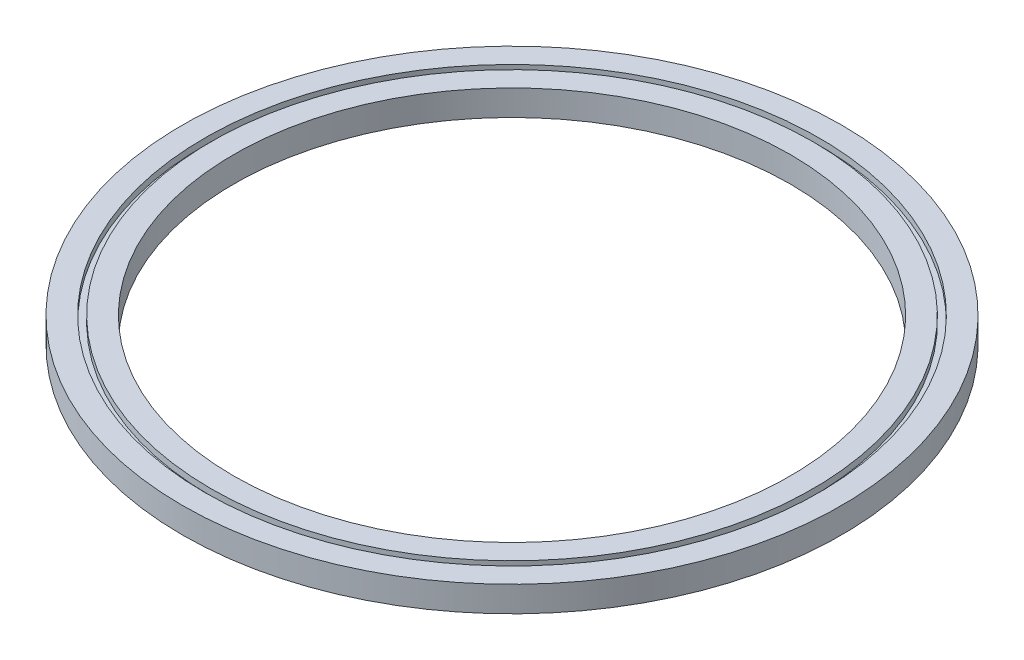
ISO-10303-21;
HEADER;
FILE_DESCRIPTION(('STEP AP214'),'2;1');
FILE_NAME('part.step','',(''),(''),'','','');
FILE_SCHEMA(('AUTOMOTIVE_DESIGN { 1 0 10303 214 1 1 1 1 }'));
ENDSEC;
DATA;
#1=APPLICATION_CONTEXT('core data for automotive mechanical design processes');
#2=APPLICATION_PROTOCOL_DEFINITION('international standard','automotive_design',2000,#1);
#3=PRODUCT_CONTEXT('',#1,'mechanical');
#4=PRODUCT('Part','Part','',(#3));
#5=PRODUCT_RELATED_PRODUCT_CATEGORY('part','',(#4));
#6=PRODUCT_DEFINITION_FORMATION('','',#4);
#7=PRODUCT_DEFINITION_CONTEXT('part definition',#1,'design');
#8=PRODUCT_DEFINITION('design','',#6,#7);
#9=PRODUCT_DEFINITION_SHAPE('','',#8);
#10=(LENGTH_UNIT() NAMED_UNIT(*) SI_UNIT(.MILLI.,.METRE.));
#11=(NAMED_UNIT(*) PLANE_ANGLE_UNIT() SI_UNIT($,.RADIAN.));
#12=(NAMED_UNIT(*) SI_UNIT($,.STERADIAN.) SOLID_ANGLE_UNIT());
#13=UNCERTAINTY_MEASURE_WITH_UNIT(LENGTH_MEASURE(1.E-05),#10,'distance_accuracy_value','');
#14=(GEOMETRIC_REPRESENTATION_CONTEXT(3) GLOBAL_UNCERTAINTY_ASSIGNED_CONTEXT((#13)) GLOBAL_UNIT_ASSIGNED_CONTEXT((#10,
#11,#12)) REPRESENTATION_CONTEXT('',''));
#15=CARTESIAN_POINT('',(0.,0.,0.));
#16=DIRECTION('',(0.,0.,1.));
#17=DIRECTION('',(1.,0.,0.));
#18=AXIS2_PLACEMENT_3D('',#15,#16,#17);
#19=CARTESIAN_POINT('',(23.5,0.,0.));
#20=DIRECTION('',(0.,-1.,0.));
#21=DIRECTION('',(0.,0.,-1.));
#22=AXIS2_PLACEMENT_3D('',#19,#20,#21);
#23=PLANE('',#22);
#24=CARTESIAN_POINT('',(0.,0.,0.));
#25=DIRECTION('',(0.,1.,0.));
#26=DIRECTION('',(0.,0.,1.));
#27=AXIS2_PLACEMENT_3D('',#24,#25,#26);
#28=CIRCLE('',#27,21.75);
#29=CARTESIAN_POINT('',(0.,0.,21.75));
#30=VERTEX_POINT('',#29);
#31=EDGE_CURVE('E10',#30,#30,#28,.T.);
#32=ORIENTED_EDGE('',*,*,#31,.F.);
#33=EDGE_LOOP('',(#32));
#34=FACE_BOUND('',#33,.T.);
#35=CARTESIAN_POINT('',(0.,0.,0.));
#36=DIRECTION('',(0.,1.,0.));
#37=DIRECTION('',(0.,0.,1.));
#38=AXIS2_PLACEMENT_3D('',#35,#36,#37);
#39=CIRCLE('',#38,23.5);
#40=CARTESIAN_POINT('',(0.,0.,23.5));
#41=VERTEX_POINT('',#40);
#42=EDGE_CURVE('E59',#41,#41,#39,.T.);
#43=ORIENTED_EDGE('',*,*,#42,.T.);
#44=EDGE_LOOP('',(#43));
#45=FACE_BOUND('',#44,.T.);
#46=ADVANCED_FACE('F31',(#34,#45),#23,.F.);
#47=CARTESIAN_POINT('',(0.,0.,0.));
#48=DIRECTION('',(0.,1.,0.));
#49=DIRECTION('',(0.,0.,1.));
#50=AXIS2_PLACEMENT_3D('',#47,#48,#49);
#51=CYLINDRICAL_SURFACE('',#50,21.75);
#52=CARTESIAN_POINT('',(0.,-2.,0.));
#53=DIRECTION('',(0.,1.,0.));
#54=DIRECTION('',(0.,0.,1.));
#55=AXIS2_PLACEMENT_3D('',#52,#53,#54);
#56=CIRCLE('',#55,21.75);
#57=CARTESIAN_POINT('',(0.,-2.,21.75));
#58=VERTEX_POINT('',#57);
#59=EDGE_CURVE('E37',#58,#58,#56,.T.);
#60=ORIENTED_EDGE('',*,*,#59,.F.);
#61=EDGE_LOOP('',(#60));
#62=FACE_BOUND('',#61,.T.);
#63=ORIENTED_EDGE('',*,*,#31,.T.);
#64=EDGE_LOOP('',(#63));
#65=FACE_BOUND('',#64,.T.);
#66=ADVANCED_FACE('F96',(#62,#65),#51,.F.);
#67=CARTESIAN_POINT('',(21.75,-2.,0.));
#68=DIRECTION('',(0.,1.,0.));
#69=DIRECTION('',(0.,0.,1.));
#70=AXIS2_PLACEMENT_3D('',#67,#68,#69);
#71=PLANE('',#70);
#72=CARTESIAN_POINT('',(0.,-2.,0.));
#73=DIRECTION('',(0.,1.,0.));
#74=DIRECTION('',(0.,0.,1.));
#75=AXIS2_PLACEMENT_3D('',#72,#73,#74);
#76=CIRCLE('',#75,25.75);
#77=CARTESIAN_POINT('',(0.,-2.,25.75));
#78=VERTEX_POINT('',#77);
#79=EDGE_CURVE('E41',#78,#78,#76,.T.);
#80=ORIENTED_EDGE('',*,*,#79,.F.);
#81=EDGE_LOOP('',(#80));
#82=FACE_BOUND('',#81,.T.);
#83=ORIENTED_EDGE('',*,*,#59,.T.);
#84=EDGE_LOOP('',(#83));
#85=FACE_BOUND('',#84,.T.);
#86=ADVANCED_FACE('F91',(#82,#85),#71,.F.);
#87=CARTESIAN_POINT('',(0.,0.,0.));
#88=DIRECTION('',(0.,1.,0.));
#89=DIRECTION('',(0.,0.,1.));
#90=AXIS2_PLACEMENT_3D('',#87,#88,#89);
#91=CYLINDRICAL_SURFACE('',#90,25.75);
#92=CARTESIAN_POINT('',(0.,0.,0.));
#93=DIRECTION('',(0.,1.,0.));
#94=DIRECTION('',(0.,0.,1.));
#95=AXIS2_PLACEMENT_3D('',#92,#93,#94);
#96=CIRCLE('',#95,25.75);
#97=CARTESIAN_POINT('',(0.,0.,25.75));
#98=VERTEX_POINT('',#97);
#99=EDGE_CURVE('E45',#98,#98,#96,.T.);
#100=ORIENTED_EDGE('',*,*,#99,.F.);
#101=EDGE_LOOP('',(#100));
#102=FACE_BOUND('',#101,.T.);
#103=ORIENTED_EDGE('',*,*,#79,.T.);
#104=EDGE_LOOP('',(#103));
#105=FACE_BOUND('',#104,.T.);
#106=ADVANCED_FACE('F85',(#102,#105),#91,.T.);
#107=CARTESIAN_POINT('',(25.75,0.,0.));
#108=DIRECTION('',(0.,-1.,0.));
#109=DIRECTION('',(0.,0.,-1.));
#110=AXIS2_PLACEMENT_3D('',#107,#108,#109);
#111=PLANE('',#110);
#112=CARTESIAN_POINT('',(0.,0.,0.));
#113=DIRECTION('',(0.,1.,0.));
#114=DIRECTION('',(0.,0.,1.));
#115=AXIS2_PLACEMENT_3D('',#112,#113,#114);
#116=CIRCLE('',#115,24.);
#117=CARTESIAN_POINT('',(0.,0.,24.));
#118=VERTEX_POINT('',#117);
#119=EDGE_CURVE('E50',#118,#118,#116,.T.);
#120=ORIENTED_EDGE('',*,*,#119,.F.);
#121=EDGE_LOOP('',(#120));
#122=FACE_BOUND('',#121,.T.);
#123=ORIENTED_EDGE('',*,*,#99,.T.);
#124=EDGE_LOOP('',(#123));
#125=FACE_BOUND('',#124,.T.);
#126=ADVANCED_FACE('F79',(#122,#125),#111,.F.);
#127=CARTESIAN_POINT('',(0.,0.,0.));
#128=DIRECTION('',(0.,1.,0.));
#129=DIRECTION('',(0.,0.,1.));
#130=AXIS2_PLACEMENT_3D('',#127,#128,#129);
#131=CYLINDRICAL_SURFACE('',#130,24.);
#132=CARTESIAN_POINT('',(0.,-0.5,0.));
#133=DIRECTION('',(0.,1.,0.));
#134=DIRECTION('',(0.,0.,1.));
#135=AXIS2_PLACEMENT_3D('',#132,#133,#134);
#136=CIRCLE('',#135,24.);
#137=CARTESIAN_POINT('',(0.,-0.5,24.));
#138=VERTEX_POINT('',#137);
#139=EDGE_CURVE('E53',#138,#138,#136,.T.);
#140=ORIENTED_EDGE('',*,*,#139,.F.);
#141=EDGE_LOOP('',(#140));
#142=FACE_BOUND('',#141,.T.);
#143=ORIENTED_EDGE('',*,*,#119,.T.);
#144=EDGE_LOOP('',(#143));
#145=FACE_BOUND('',#144,.T.);
#146=ADVANCED_FACE('F73',(#142,#145),#131,.F.);
#147=CARTESIAN_POINT('',(24.,-0.5,0.));
#148=DIRECTION('',(0.,-1.,0.));
#149=DIRECTION('',(0.,0.,-1.));
#150=AXIS2_PLACEMENT_3D('',#147,#148,#149);
#151=PLANE('',#150);
#152=CARTESIAN_POINT('',(0.,-0.5,0.));
#153=DIRECTION('',(0.,1.,0.));
#154=DIRECTION('',(0.,0.,1.));
#155=AXIS2_PLACEMENT_3D('',#152,#153,#154);
#156=CIRCLE('',#155,23.5);
#157=CARTESIAN_POINT('',(0.,-0.5,23.5));
#158=VERTEX_POINT('',#157);
#159=EDGE_CURVE('E56',#158,#158,#156,.T.);
#160=ORIENTED_EDGE('',*,*,#159,.F.);
#161=EDGE_LOOP('',(#160));
#162=FACE_BOUND('',#161,.T.);
#163=ORIENTED_EDGE('',*,*,#139,.T.);
#164=EDGE_LOOP('',(#163));
#165=FACE_BOUND('',#164,.T.);
#166=ADVANCED_FACE('F67',(#162,#165),#151,.F.);
#167=CARTESIAN_POINT('',(0.,0.,0.));
#168=DIRECTION('',(0.,1.,0.));
#169=DIRECTION('',(0.,0.,1.));
#170=AXIS2_PLACEMENT_3D('',#167,#168,#169);
#171=CYLINDRICAL_SURFACE('',#170,23.5);
#172=ORIENTED_EDGE('',*,*,#42,.F.);
#173=EDGE_LOOP('',(#172));
#174=FACE_BOUND('',#173,.T.);
#175=ORIENTED_EDGE('',*,*,#159,.T.);
#176=EDGE_LOOP('',(#175));
#177=FACE_BOUND('',#176,.T.);
#178=ADVANCED_FACE('F64',(#174,#177),#171,.T.);
#179=CLOSED_SHELL('',(#46,#66,#86,#106,#126,#146,#166,#178));
#180=MANIFOLD_SOLID_BREP('B2',#179);
#181=ADVANCED_BREP_SHAPE_REPRESENTATION('',(#18,#180),#14);
#182=SHAPE_DEFINITION_REPRESENTATION(#9,#181);
ENDSEC;
END-ISO-10303-21;
